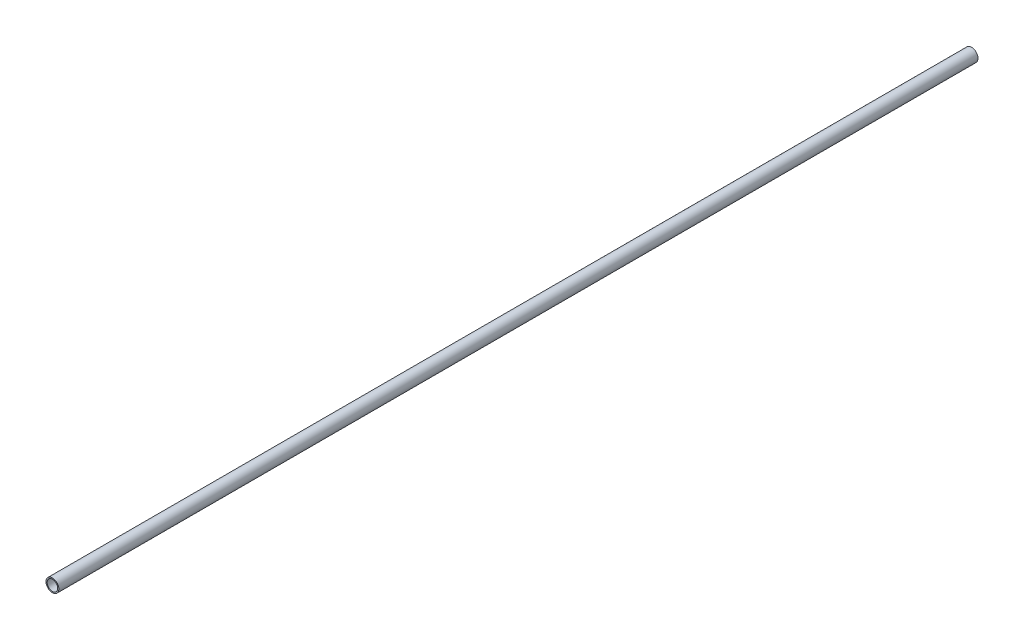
ISO-10303-21;
HEADER;
FILE_DESCRIPTION(('STEP AP214'),'2;1');
FILE_NAME('part.step','',(''),(''),'','','');
FILE_SCHEMA(('AUTOMOTIVE_DESIGN { 1 0 10303 214 1 1 1 1 }'));
ENDSEC;
DATA;
#1=APPLICATION_CONTEXT('core data for automotive mechanical design processes');
#2=APPLICATION_PROTOCOL_DEFINITION('international standard','automotive_design',2000,#1);
#3=PRODUCT_CONTEXT('',#1,'mechanical');
#4=PRODUCT('Part','Part','',(#3));
#5=PRODUCT_RELATED_PRODUCT_CATEGORY('part','',(#4));
#6=PRODUCT_DEFINITION_FORMATION('','',#4);
#7=PRODUCT_DEFINITION_CONTEXT('part definition',#1,'design');
#8=PRODUCT_DEFINITION('design','',#6,#7);
#9=PRODUCT_DEFINITION_SHAPE('','',#8);
#10=(LENGTH_UNIT() NAMED_UNIT(*) SI_UNIT(.MILLI.,.METRE.));
#11=(NAMED_UNIT(*) PLANE_ANGLE_UNIT() SI_UNIT($,.RADIAN.));
#12=(NAMED_UNIT(*) SI_UNIT($,.STERADIAN.) SOLID_ANGLE_UNIT());
#13=UNCERTAINTY_MEASURE_WITH_UNIT(LENGTH_MEASURE(1.E-05),#10,'distance_accuracy_value','');
#14=(GEOMETRIC_REPRESENTATION_CONTEXT(3) GLOBAL_UNCERTAINTY_ASSIGNED_CONTEXT((#13)) GLOBAL_UNIT_ASSIGNED_CONTEXT((#10,
#11,#12)) REPRESENTATION_CONTEXT('',''));
#15=CARTESIAN_POINT('',(0.,0.,0.));
#16=DIRECTION('',(0.,0.,1.));
#17=DIRECTION('',(1.,0.,0.));
#18=AXIS2_PLACEMENT_3D('',#15,#16,#17);
#19=CARTESIAN_POINT('',(1.11022302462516E-12,9.15933995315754E-13,700.));
#20=DIRECTION('',(0.,0.,1.));
#21=DIRECTION('',(1.00000000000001,0.,0.));
#22=AXIS2_PLACEMENT_3D('',#19,#20,#21);
#23=PLANE('',#22);
#24=CARTESIAN_POINT('',(1.11022302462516E-12,9.15933995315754E-13,700.));
#25=DIRECTION('',(0.,0.,1.));
#26=DIRECTION('',(1.00000000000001,0.,0.));
#27=AXIS2_PLACEMENT_3D('',#24,#25,#26);
#28=CIRCLE('',#27,4.9);
#29=CARTESIAN_POINT('',(4.90000000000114,9.07773856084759E-13,700.));
#30=VERTEX_POINT('',#29);
#31=EDGE_CURVE('E10',#30,#30,#28,.T.);
#32=ORIENTED_EDGE('',*,*,#31,.T.);
#33=EDGE_LOOP('',(#32));
#34=FACE_BOUND('',#33,.T.);
#35=CARTESIAN_POINT('',(1.11022302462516E-12,9.15933995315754E-13,700.));
#36=DIRECTION('',(0.,0.,1.));
#37=DIRECTION('',(1.00000000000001,0.,0.));
#38=AXIS2_PLACEMENT_3D('',#35,#36,#37);
#39=CIRCLE('',#38,4.);
#40=CARTESIAN_POINT('',(4.00000000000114,9.09272657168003E-13,700.));
#41=VERTEX_POINT('',#40);
#42=EDGE_CURVE('E53',#41,#41,#39,.T.);
#43=ORIENTED_EDGE('',*,*,#42,.F.);
#44=EDGE_LOOP('',(#43));
#45=FACE_BOUND('',#44,.T.);
#46=ADVANCED_FACE('F42',(#34,#45),#23,.T.);
#47=CARTESIAN_POINT('',(0.,0.,0.));
#48=DIRECTION('',(0.,0.,1.));
#49=DIRECTION('',(1.00000000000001,0.,0.));
#50=AXIS2_PLACEMENT_3D('',#47,#48,#49);
#51=PLANE('',#50);
#52=CARTESIAN_POINT('',(0.,0.,0.));
#53=DIRECTION('',(0.,0.,1.));
#54=DIRECTION('',(1.00000000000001,0.,0.));
#55=AXIS2_PLACEMENT_3D('',#52,#53,#54);
#56=CIRCLE('',#55,4.9);
#57=CARTESIAN_POINT('',(4.90000000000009,0.,0.));
#58=VERTEX_POINT('',#57);
#59=EDGE_CURVE('E49',#58,#58,#56,.T.);
#60=ORIENTED_EDGE('',*,*,#59,.F.);
#61=EDGE_LOOP('',(#60));
#62=FACE_BOUND('',#61,.T.);
#63=CARTESIAN_POINT('',(0.,0.,0.));
#64=DIRECTION('',(0.,0.,1.));
#65=DIRECTION('',(1.00000000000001,0.,0.));
#66=AXIS2_PLACEMENT_3D('',#63,#64,#65);
#67=CIRCLE('',#66,4.);
#68=CARTESIAN_POINT('',(4.00000000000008,0.,0.));
#69=VERTEX_POINT('',#68);
#70=EDGE_CURVE('E57',#69,#69,#67,.T.);
#71=ORIENTED_EDGE('',*,*,#70,.T.);
#72=EDGE_LOOP('',(#71));
#73=FACE_BOUND('',#72,.T.);
#74=ADVANCED_FACE('F63',(#62,#73),#51,.F.);
#75=CARTESIAN_POINT('',(1.11022302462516E-12,9.15933995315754E-13,700.));
#76=DIRECTION('',(0.,0.,-1.));
#77=DIRECTION('',(-1.00000000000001,0.,0.));
#78=AXIS2_PLACEMENT_3D('',#75,#76,#77);
#79=CYLINDRICAL_SURFACE('',#78,4.9);
#80=ORIENTED_EDGE('',*,*,#31,.F.);
#81=EDGE_LOOP('',(#80));
#82=FACE_BOUND('',#81,.T.);
#83=ORIENTED_EDGE('',*,*,#59,.T.);
#84=EDGE_LOOP('',(#83));
#85=FACE_BOUND('',#84,.T.);
#86=ADVANCED_FACE('F44',(#82,#85),#79,.T.);
#87=CARTESIAN_POINT('',(1.11022302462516E-12,9.15933995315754E-13,700.));
#88=DIRECTION('',(0.,0.,-1.));
#89=DIRECTION('',(-1.00000000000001,0.,0.));
#90=AXIS2_PLACEMENT_3D('',#87,#88,#89);
#91=CYLINDRICAL_SURFACE('',#90,4.);
#92=ORIENTED_EDGE('',*,*,#42,.T.);
#93=EDGE_LOOP('',(#92));
#94=FACE_BOUND('',#93,.T.);
#95=ORIENTED_EDGE('',*,*,#70,.F.);
#96=EDGE_LOOP('',(#95));
#97=FACE_BOUND('',#96,.T.);
#98=ADVANCED_FACE('F65',(#94,#97),#91,.F.);
#99=CLOSED_SHELL('',(#46,#74,#86,#98));
#100=MANIFOLD_SOLID_BREP('B2',#99);
#101=ADVANCED_BREP_SHAPE_REPRESENTATION('',(#18,#100),#14);
#102=SHAPE_DEFINITION_REPRESENTATION(#9,#101);
ENDSEC;
END-ISO-10303-21;
